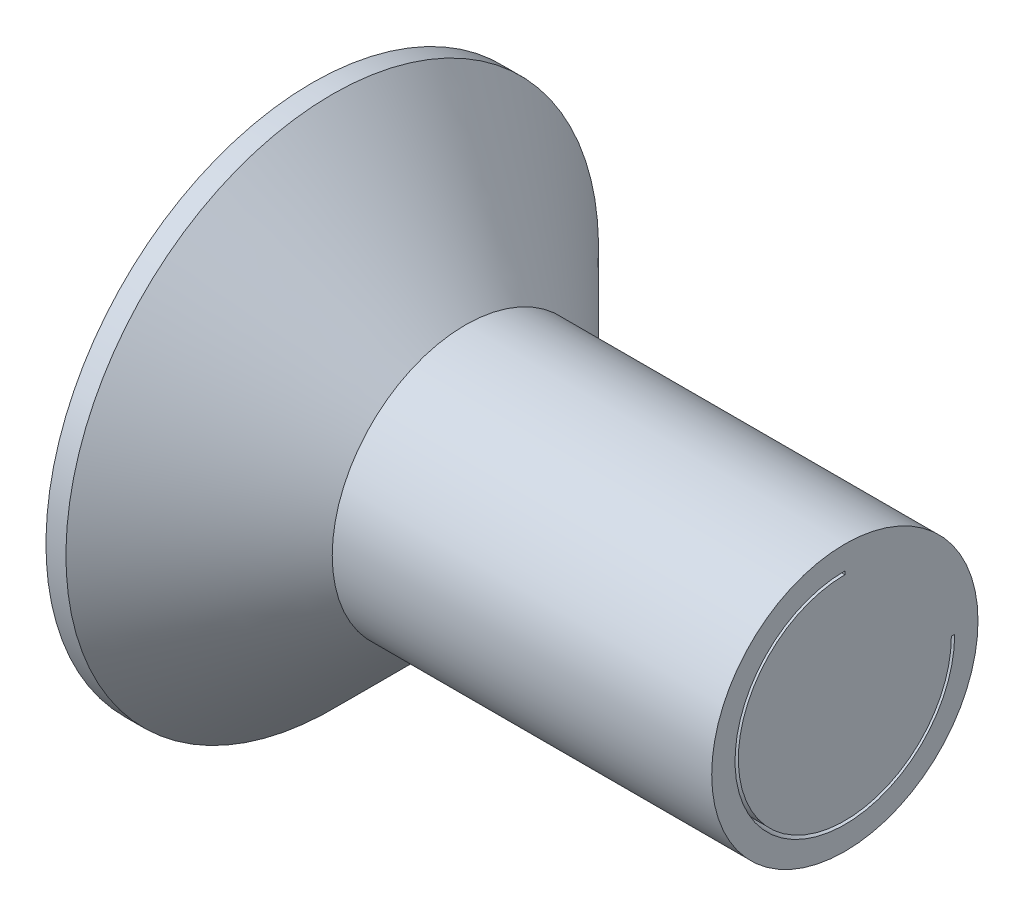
ISO-10303-21;
HEADER;
FILE_DESCRIPTION(('STEP AP214'),'2;1');
FILE_NAME('part.step','',(''),(''),'','','');
FILE_SCHEMA(('AUTOMOTIVE_DESIGN { 1 0 10303 214 1 1 1 1 }'));
ENDSEC;
DATA;
#1=APPLICATION_CONTEXT('core data for automotive mechanical design processes');
#2=APPLICATION_PROTOCOL_DEFINITION('international standard','automotive_design',2000,#1);
#3=PRODUCT_CONTEXT('',#1,'mechanical');
#4=PRODUCT('Part','Part','',(#3));
#5=PRODUCT_RELATED_PRODUCT_CATEGORY('part','',(#4));
#6=PRODUCT_DEFINITION_FORMATION('','',#4);
#7=PRODUCT_DEFINITION_CONTEXT('part definition',#1,'design');
#8=PRODUCT_DEFINITION('design','',#6,#7);
#9=PRODUCT_DEFINITION_SHAPE('','',#8);
#10=(LENGTH_UNIT() NAMED_UNIT(*) SI_UNIT(.MILLI.,.METRE.));
#11=(NAMED_UNIT(*) PLANE_ANGLE_UNIT() SI_UNIT($,.RADIAN.));
#12=(NAMED_UNIT(*) SI_UNIT($,.STERADIAN.) SOLID_ANGLE_UNIT());
#13=UNCERTAINTY_MEASURE_WITH_UNIT(LENGTH_MEASURE(1.E-05),#10,'distance_accuracy_value','');
#14=(GEOMETRIC_REPRESENTATION_CONTEXT(3) GLOBAL_UNCERTAINTY_ASSIGNED_CONTEXT((#13)) GLOBAL_UNIT_ASSIGNED_CONTEXT((#10,
#11,#12)) REPRESENTATION_CONTEXT('',''));
#15=CARTESIAN_POINT('',(0.,0.,0.));
#16=DIRECTION('',(0.,0.,1.));
#17=DIRECTION('',(1.,0.,0.));
#18=AXIS2_PLACEMENT_3D('',#15,#16,#17);
#19=CARTESIAN_POINT('',(-119.,35.0000000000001,86.0000000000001));
#20=DIRECTION('',(1.,0.,0.));
#21=DIRECTION('',(0.,0.,-1.));
#22=AXIS2_PLACEMENT_3D('',#19,#20,#21);
#23=PLANE('',#22);
#24=CARTESIAN_POINT('',(-119.,34.0000000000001,86.0000000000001));
#25=DIRECTION('',(-1.,0.,0.));
#26=DIRECTION('',(0.,1.,0.));
#27=AXIS2_PLACEMENT_3D('',#24,#25,#26);
#28=CIRCLE('',#27,1.6);
#29=CARTESIAN_POINT('',(-119.,34.0000000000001,84.4000000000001));
#30=VERTEX_POINT('',#29);
#31=CARTESIAN_POINT('',(-119.,35.6000000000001,86.0000000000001));
#32=VERTEX_POINT('',#31);
#33=EDGE_CURVE('E9',#30,#32,#28,.T.);
#34=ORIENTED_EDGE('',*,*,#33,.T.);
#35=DIRECTION('',(0.,1.,0.));
#36=VECTOR('',#35,1.);
#37=CARTESIAN_POINT('',(-119.,35.3125000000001,86.0000000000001));
#38=LINE('',#37,#36);
#39=CARTESIAN_POINT('',(-119.,35.6500000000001,86.0000000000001));
#40=VERTEX_POINT('',#39);
#41=EDGE_CURVE('E25',#32,#40,#38,.T.);
#42=ORIENTED_EDGE('',*,*,#41,.T.);
#43=CARTESIAN_POINT('',(-119.,34.0000000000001,86.0000000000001));
#44=DIRECTION('',(1.,0.,0.));
#45=DIRECTION('',(0.,1.,0.));
#46=AXIS2_PLACEMENT_3D('',#43,#44,#45);
#47=CIRCLE('',#46,1.65);
#48=CARTESIAN_POINT('',(-119.,34.0000000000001,84.3500000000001));
#49=VERTEX_POINT('',#48);
#50=EDGE_CURVE('E135',#40,#49,#47,.T.);
#51=ORIENTED_EDGE('',*,*,#50,.T.);
#52=DIRECTION('',(0.,0.,1.));
#53=VECTOR('',#52,1.);
#54=CARTESIAN_POINT('',(-119.,34.0000000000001,85.1875000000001));
#55=LINE('',#54,#53);
#56=EDGE_CURVE('E132',#49,#30,#55,.T.);
#57=ORIENTED_EDGE('',*,*,#56,.T.);
#58=EDGE_LOOP('',(#34,#42,#51,#57));
#59=FACE_BOUND('',#58,.T.);
#60=ADVANCED_FACE('F14',(#59),#23,.T.);
#61=DIRECTION('',(0.707106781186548,-0.707106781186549,0.));
#62=VECTOR('',#61,1.);
#63=CARTESIAN_POINT('',(-499000.,498917.000000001,86.0000000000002));
#64=LINE('',#63,#62);
#65=CARTESIAN_POINT('',(-117.,34.0000000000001,86.0000000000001));
#66=DIRECTION('',(-1.,0.,0.));
#67=AXIS1_PLACEMENT('',#65,#66);
#68=SURFACE_OF_REVOLUTION('',#64,#67);
#69=CARTESIAN_POINT('',(-121.,34.0000000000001,86.0000000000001));
#70=DIRECTION('',(1.,0.,0.));
#71=DIRECTION('',(0.,1.,0.));
#72=AXIS2_PLACEMENT_3D('',#69,#70,#71);
#73=CIRCLE('',#72,4.);
#74=CARTESIAN_POINT('',(-121.,38.0000000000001,86.0000000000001));
#75=VERTEX_POINT('',#74);
#76=EDGE_CURVE('E197',#75,#75,#73,.T.);
#77=ORIENTED_EDGE('',*,*,#76,.T.);
#78=EDGE_LOOP('',(#77));
#79=FACE_BOUND('',#78,.T.);
#80=CARTESIAN_POINT('',(-119.,34.0000000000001,86.0000000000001));
#81=DIRECTION('',(1.,0.,0.));
#82=DIRECTION('',(0.,1.,0.));
#83=AXIS2_PLACEMENT_3D('',#80,#81,#82);
#84=CIRCLE('',#83,2.);
#85=CARTESIAN_POINT('',(-119.,36.0000000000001,86.0000000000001));
#86=VERTEX_POINT('',#85);
#87=EDGE_CURVE('E196',#86,#86,#84,.T.);
#88=ORIENTED_EDGE('',*,*,#87,.F.);
#89=EDGE_LOOP('',(#88));
#90=FACE_BOUND('',#89,.T.);
#91=ADVANCED_FACE('F256',(#79,#90),#68,.F.);
#92=CARTESIAN_POINT('',(-121.15,34.0000000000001,86.0000000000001));
#93=DIRECTION('',(-1.,0.,0.));
#94=DIRECTION('',(0.,0.,1.));
#95=AXIS2_PLACEMENT_3D('',#92,#93,#94);
#96=CYLINDRICAL_SURFACE('',#95,4.);
#97=CARTESIAN_POINT('',(-121.3,34.0000000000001,86.0000000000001));
#98=DIRECTION('',(1.,0.,0.));
#99=DIRECTION('',(0.,1.,0.));
#100=AXIS2_PLACEMENT_3D('',#97,#98,#99);
#101=CIRCLE('',#100,4.);
#102=CARTESIAN_POINT('',(-121.3,38.0000000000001,86.0000000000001));
#103=VERTEX_POINT('',#102);
#104=EDGE_CURVE('E192',#103,#103,#101,.T.);
#105=ORIENTED_EDGE('',*,*,#104,.T.);
#106=EDGE_LOOP('',(#105));
#107=FACE_BOUND('',#106,.T.);
#108=ORIENTED_EDGE('',*,*,#76,.F.);
#109=EDGE_LOOP('',(#108));
#110=FACE_BOUND('',#109,.T.);
#111=ADVANCED_FACE('F248',(#107,#110),#96,.T.);
#112=CARTESIAN_POINT('',(-121.3,36.0000000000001,86.0000000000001));
#113=DIRECTION('',(-1.,0.,0.));
#114=DIRECTION('',(0.,0.,1.));
#115=AXIS2_PLACEMENT_3D('',#112,#113,#114);
#116=PLANE('',#115);
#117=ORIENTED_EDGE('',*,*,#104,.F.);
#118=EDGE_LOOP('',(#117));
#119=FACE_BOUND('',#118,.T.);
#120=DIRECTION('',(0.,-0.499999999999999,0.866025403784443));
#121=VECTOR('',#120,1.);
#122=CARTESIAN_POINT('',(-121.3,35.1521097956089,86.5044872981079));
#123=LINE('',#122,#121);
#124=CARTESIAN_POINT('',(-121.3,35.4433756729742,86.0000000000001));
#125=VERTEX_POINT('',#124);
#126=CARTESIAN_POINT('',(-121.3,34.7216878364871,87.2500000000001));
#127=VERTEX_POINT('',#126);
#128=EDGE_CURVE('E136',#125,#127,#123,.T.);
#129=ORIENTED_EDGE('',*,*,#128,.T.);
#130=DIRECTION('',(0.,-1.,0.));
#131=VECTOR('',#130,1.);
#132=CARTESIAN_POINT('',(-121.3,34.6391560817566,87.2500000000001));
#133=LINE('',#132,#131);
#134=CARTESIAN_POINT('',(-121.3,33.2783121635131,87.2500000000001));
#135=VERTEX_POINT('',#134);
#136=EDGE_CURVE('E188',#127,#135,#133,.T.);
#137=ORIENTED_EDGE('',*,*,#136,.T.);
#138=DIRECTION('',(0.,-0.499999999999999,-0.866025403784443));
#139=VECTOR('',#138,1.);
#140=CARTESIAN_POINT('',(-121.3,32.9870462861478,86.7455127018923));
#141=LINE('',#140,#139);
#142=CARTESIAN_POINT('',(-121.3,32.556624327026,86.0000000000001));
#143=VERTEX_POINT('',#142);
#144=EDGE_CURVE('E166',#135,#143,#141,.T.);
#145=ORIENTED_EDGE('',*,*,#144,.T.);
#146=DIRECTION('',(0.,0.499999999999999,-0.866025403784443));
#147=VECTOR('',#146,1.);
#148=CARTESIAN_POINT('',(-121.3,33.3478902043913,84.6294872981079));
#149=LINE('',#148,#147);
#150=CARTESIAN_POINT('',(-121.3,33.2783121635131,84.7500000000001));
#151=VERTEX_POINT('',#150);
#152=EDGE_CURVE('E163',#143,#151,#149,.T.);
#153=ORIENTED_EDGE('',*,*,#152,.T.);
#154=DIRECTION('',(0.,1.,0.));
#155=VECTOR('',#154,1.);
#156=CARTESIAN_POINT('',(-121.3,35.3608439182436,84.7500000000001));
#157=LINE('',#156,#155);
#158=CARTESIAN_POINT('',(-121.3,34.7216878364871,84.7500000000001));
#159=VERTEX_POINT('',#158);
#160=EDGE_CURVE('E156',#151,#159,#157,.T.);
#161=ORIENTED_EDGE('',*,*,#160,.T.);
#162=DIRECTION('',(0.,0.499999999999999,0.866025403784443));
#163=VECTOR('',#162,1.);
#164=CARTESIAN_POINT('',(-121.3,35.5129537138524,86.1205127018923));
#165=LINE('',#164,#163);
#166=EDGE_CURVE('E141',#159,#125,#165,.T.);
#167=ORIENTED_EDGE('',*,*,#166,.T.);
#168=EDGE_LOOP('',(#129,#137,#145,#153,#161,#167));
#169=FACE_BOUND('',#168,.T.);
#170=ADVANCED_FACE('F246',(#119,#169),#116,.T.);
#171=CARTESIAN_POINT('',(-119.5,34.0000000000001,86.0000000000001));
#172=DIRECTION('',(-1.,0.,0.));
#173=DIRECTION('',(0.,-1.,0.));
#174=AXIS2_PLACEMENT_3D('',#171,#172,#173);
#175=PLANE('',#174);
#176=DIRECTION('',(0.,0.499999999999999,-0.866025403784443));
#177=VECTOR('',#176,1.);
#178=CARTESIAN_POINT('',(-119.5,34.7216878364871,87.2500000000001));
#179=LINE('',#178,#177);
#180=CARTESIAN_POINT('',(-119.5,34.7216878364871,87.2500000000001));
#181=VERTEX_POINT('',#180);
#182=CARTESIAN_POINT('',(-119.5,35.4433756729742,86.0000000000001));
#183=VERTEX_POINT('',#182);
#184=EDGE_CURVE('E137',#181,#183,#179,.T.);
#185=ORIENTED_EDGE('',*,*,#184,.T.);
#186=DIRECTION('',(0.,-0.499999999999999,-0.866025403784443));
#187=VECTOR('',#186,1.);
#188=CARTESIAN_POINT('',(-119.5,35.4433756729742,86.0000000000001));
#189=LINE('',#188,#187);
#190=CARTESIAN_POINT('',(-119.5,34.7216878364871,84.7500000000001));
#191=VERTEX_POINT('',#190);
#192=EDGE_CURVE('E130',#183,#191,#189,.T.);
#193=ORIENTED_EDGE('',*,*,#192,.T.);
#194=DIRECTION('',(0.,-1.,0.));
#195=VECTOR('',#194,1.);
#196=CARTESIAN_POINT('',(-119.5,34.7216878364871,84.7500000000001));
#197=LINE('',#196,#195);
#198=CARTESIAN_POINT('',(-119.5,33.2783121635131,84.7500000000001));
#199=VERTEX_POINT('',#198);
#200=EDGE_CURVE('E126',#191,#199,#197,.T.);
#201=ORIENTED_EDGE('',*,*,#200,.T.);
#202=DIRECTION('',(0.,-0.499999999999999,0.866025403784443));
#203=VECTOR('',#202,1.);
#204=CARTESIAN_POINT('',(-119.5,33.2783121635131,84.7500000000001));
#205=LINE('',#204,#203);
#206=CARTESIAN_POINT('',(-119.5,32.556624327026,86.0000000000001));
#207=VERTEX_POINT('',#206);
#208=EDGE_CURVE('E131',#199,#207,#205,.T.);
#209=ORIENTED_EDGE('',*,*,#208,.T.);
#210=DIRECTION('',(0.,0.499999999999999,0.866025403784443));
#211=VECTOR('',#210,1.);
#212=CARTESIAN_POINT('',(-119.5,32.556624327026,86.0000000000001));
#213=LINE('',#212,#211);
#214=CARTESIAN_POINT('',(-119.5,33.2783121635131,87.2500000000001));
#215=VERTEX_POINT('',#214);
#216=EDGE_CURVE('E142',#207,#215,#213,.T.);
#217=ORIENTED_EDGE('',*,*,#216,.T.);
#218=DIRECTION('',(0.,1.,0.));
#219=VECTOR('',#218,1.);
#220=CARTESIAN_POINT('',(-119.5,33.2783121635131,87.2500000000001));
#221=LINE('',#220,#219);
#222=EDGE_CURVE('E146',#215,#181,#221,.T.);
#223=ORIENTED_EDGE('',*,*,#222,.T.);
#224=EDGE_LOOP('',(#185,#193,#201,#209,#217,#223));
#225=FACE_BOUND('',#224,.T.);
#226=ADVANCED_FACE('F222',(#225),#175,.T.);
#227=CARTESIAN_POINT('',(-121.3,33.2783121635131,87.2500000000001));
#228=DIRECTION('',(0.,0.,-1.));
#229=DIRECTION('',(-1.,0.,0.));
#230=AXIS2_PLACEMENT_3D('',#227,#228,#229);
#231=PLANE('',#230);
#232=ORIENTED_EDGE('',*,*,#222,.F.);
#233=DIRECTION('',(1.,0.,0.));
#234=VECTOR('',#233,1.);
#235=CARTESIAN_POINT('',(-121.3,33.2783121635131,87.2500000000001));
#236=LINE('',#235,#234);
#237=EDGE_CURVE('E172',#135,#215,#236,.T.);
#238=ORIENTED_EDGE('',*,*,#237,.F.);
#239=ORIENTED_EDGE('',*,*,#136,.F.);
#240=DIRECTION('',(1.,0.,0.));
#241=VECTOR('',#240,1.);
#242=CARTESIAN_POINT('',(-121.3,34.7216878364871,87.2500000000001));
#243=LINE('',#242,#241);
#244=EDGE_CURVE('E160',#127,#181,#243,.T.);
#245=ORIENTED_EDGE('',*,*,#244,.T.);
#246=EDGE_LOOP('',(#232,#238,#239,#245));
#247=FACE_BOUND('',#246,.T.);
#248=ADVANCED_FACE('F230',(#247),#231,.T.);
#249=CARTESIAN_POINT('',(-121.3,32.556624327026,86.0000000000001));
#250=DIRECTION('',(0.,0.866025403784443,-0.499999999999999));
#251=DIRECTION('',(0.,0.499999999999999,0.866025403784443));
#252=AXIS2_PLACEMENT_3D('',#249,#250,#251);
#253=PLANE('',#252);
#254=ORIENTED_EDGE('',*,*,#216,.F.);
#255=DIRECTION('',(1.,0.,0.));
#256=VECTOR('',#255,1.);
#257=CARTESIAN_POINT('',(-121.3,32.556624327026,86.0000000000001));
#258=LINE('',#257,#256);
#259=EDGE_CURVE('E180',#143,#207,#258,.T.);
#260=ORIENTED_EDGE('',*,*,#259,.F.);
#261=ORIENTED_EDGE('',*,*,#144,.F.);
#262=ORIENTED_EDGE('',*,*,#237,.T.);
#263=EDGE_LOOP('',(#254,#260,#261,#262));
#264=FACE_BOUND('',#263,.T.);
#265=ADVANCED_FACE('F226',(#264),#253,.T.);
#266=CARTESIAN_POINT('',(-121.3,33.2783121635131,84.7500000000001));
#267=DIRECTION('',(0.,0.866025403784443,0.499999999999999));
#268=DIRECTION('',(0.,-0.499999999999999,0.866025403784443));
#269=AXIS2_PLACEMENT_3D('',#266,#267,#268);
#270=PLANE('',#269);
#271=ORIENTED_EDGE('',*,*,#208,.F.);
#272=DIRECTION('',(1.,0.,0.));
#273=VECTOR('',#272,1.);
#274=CARTESIAN_POINT('',(-121.3,33.2783121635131,84.7500000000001));
#275=LINE('',#274,#273);
#276=EDGE_CURVE('E178',#151,#199,#275,.T.);
#277=ORIENTED_EDGE('',*,*,#276,.F.);
#278=ORIENTED_EDGE('',*,*,#152,.F.);
#279=ORIENTED_EDGE('',*,*,#259,.T.);
#280=EDGE_LOOP('',(#271,#277,#278,#279));
#281=FACE_BOUND('',#280,.T.);
#282=ADVANCED_FACE('F244',(#281),#270,.T.);
#283=CARTESIAN_POINT('',(-121.3,34.7216878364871,84.7500000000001));
#284=DIRECTION('',(0.,0.,1.));
#285=DIRECTION('',(1.,0.,0.));
#286=AXIS2_PLACEMENT_3D('',#283,#284,#285);
#287=PLANE('',#286);
#288=ORIENTED_EDGE('',*,*,#200,.F.);
#289=DIRECTION('',(1.,0.,0.));
#290=VECTOR('',#289,1.);
#291=CARTESIAN_POINT('',(-121.3,34.7216878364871,84.7500000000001));
#292=LINE('',#291,#290);
#293=EDGE_CURVE('E175',#159,#191,#292,.T.);
#294=ORIENTED_EDGE('',*,*,#293,.F.);
#295=ORIENTED_EDGE('',*,*,#160,.F.);
#296=ORIENTED_EDGE('',*,*,#276,.T.);
#297=EDGE_LOOP('',(#288,#294,#295,#296));
#298=FACE_BOUND('',#297,.T.);
#299=ADVANCED_FACE('F241',(#298),#287,.T.);
#300=CARTESIAN_POINT('',(-121.3,35.4433756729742,86.0000000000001));
#301=DIRECTION('',(0.,-0.866025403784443,0.499999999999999));
#302=DIRECTION('',(0.,-0.499999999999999,-0.866025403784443));
#303=AXIS2_PLACEMENT_3D('',#300,#301,#302);
#304=PLANE('',#303);
#305=ORIENTED_EDGE('',*,*,#192,.F.);
#306=DIRECTION('',(1.,0.,0.));
#307=VECTOR('',#306,1.);
#308=CARTESIAN_POINT('',(-121.3,35.4433756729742,86.0000000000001));
#309=LINE('',#308,#307);
#310=EDGE_CURVE('E149',#125,#183,#309,.T.);
#311=ORIENTED_EDGE('',*,*,#310,.F.);
#312=ORIENTED_EDGE('',*,*,#166,.F.);
#313=ORIENTED_EDGE('',*,*,#293,.T.);
#314=EDGE_LOOP('',(#305,#311,#312,#313));
#315=FACE_BOUND('',#314,.T.);
#316=ADVANCED_FACE('F239',(#315),#304,.T.);
#317=CARTESIAN_POINT('',(-121.3,34.7216878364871,87.2500000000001));
#318=DIRECTION('',(0.,-0.866025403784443,-0.499999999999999));
#319=DIRECTION('',(0.,0.499999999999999,-0.866025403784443));
#320=AXIS2_PLACEMENT_3D('',#317,#318,#319);
#321=PLANE('',#320);
#322=ORIENTED_EDGE('',*,*,#184,.F.);
#323=ORIENTED_EDGE('',*,*,#244,.F.);
#324=ORIENTED_EDGE('',*,*,#128,.F.);
#325=ORIENTED_EDGE('',*,*,#310,.T.);
#326=EDGE_LOOP('',(#322,#323,#324,#325));
#327=FACE_BOUND('',#326,.T.);
#328=ADVANCED_FACE('F234',(#327),#321,.T.);
#329=CARTESIAN_POINT('',(-113.3,34.0000000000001,86.0000000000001));
#330=DIRECTION('',(1.,0.,0.));
#331=DIRECTION('',(0.,0.,-1.));
#332=AXIS2_PLACEMENT_3D('',#329,#330,#331);
#333=PLANE('',#332);
#334=CARTESIAN_POINT('',(-113.3,34.0000000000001,86.0000000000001));
#335=DIRECTION('',(1.,0.,0.));
#336=DIRECTION('',(0.,0.,-1.));
#337=AXIS2_PLACEMENT_3D('',#334,#335,#336);
#338=CIRCLE('',#337,2.);
#339=CARTESIAN_POINT('',(-113.3,34.0000000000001,84.0000000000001));
#340=VERTEX_POINT('',#339);
#341=EDGE_CURVE('E110',#340,#340,#338,.T.);
#342=ORIENTED_EDGE('',*,*,#341,.T.);
#343=EDGE_LOOP('',(#342));
#344=FACE_BOUND('',#343,.T.);
#345=CARTESIAN_POINT('',(-113.3,34.0000000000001,86.0000000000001));
#346=DIRECTION('',(1.,0.,0.));
#347=DIRECTION('',(0.,1.,0.));
#348=AXIS2_PLACEMENT_3D('',#345,#346,#347);
#349=CIRCLE('',#348,1.6);
#350=CARTESIAN_POINT('',(-113.3,35.6000000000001,86.0000000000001));
#351=VERTEX_POINT('',#350);
#352=CARTESIAN_POINT('',(-113.3,34.0000000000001,84.4000000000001));
#353=VERTEX_POINT('',#352);
#354=EDGE_CURVE('E104',#351,#353,#349,.T.);
#355=ORIENTED_EDGE('',*,*,#354,.T.);
#356=DIRECTION('',(0.,0.,-1.));
#357=VECTOR('',#356,1.);
#358=CARTESIAN_POINT('',(-113.3,34.0000000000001,85.1875000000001));
#359=LINE('',#358,#357);
#360=CARTESIAN_POINT('',(-113.3,34.0000000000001,84.3500000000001));
#361=VERTEX_POINT('',#360);
#362=EDGE_CURVE('E111',#353,#361,#359,.T.);
#363=ORIENTED_EDGE('',*,*,#362,.T.);
#364=CARTESIAN_POINT('',(-113.3,34.0000000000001,86.0000000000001));
#365=DIRECTION('',(-1.,0.,0.));
#366=DIRECTION('',(0.,1.,0.));
#367=AXIS2_PLACEMENT_3D('',#364,#365,#366);
#368=CIRCLE('',#367,1.65);
#369=CARTESIAN_POINT('',(-113.3,35.6500000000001,86.0000000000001));
#370=VERTEX_POINT('',#369);
#371=EDGE_CURVE('E114',#361,#370,#368,.T.);
#372=ORIENTED_EDGE('',*,*,#371,.T.);
#373=DIRECTION('',(0.,-1.,0.));
#374=VECTOR('',#373,1.);
#375=CARTESIAN_POINT('',(-113.3,34.8125000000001,86.0000000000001));
#376=LINE('',#375,#374);
#377=EDGE_CURVE('E98',#370,#351,#376,.T.);
#378=ORIENTED_EDGE('',*,*,#377,.T.);
#379=EDGE_LOOP('',(#355,#363,#372,#378));
#380=FACE_BOUND('',#379,.T.);
#381=ADVANCED_FACE('F113',(#344,#380),#333,.T.);
#382=CARTESIAN_POINT('',(-116.15,34.0000000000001,86.0000000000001));
#383=DIRECTION('',(-1.,0.,0.));
#384=DIRECTION('',(0.,0.,1.));
#385=AXIS2_PLACEMENT_3D('',#382,#383,#384);
#386=CYLINDRICAL_SURFACE('',#385,2.);
#387=ORIENTED_EDGE('',*,*,#87,.T.);
#388=EDGE_LOOP('',(#387));
#389=FACE_BOUND('',#388,.T.);
#390=ORIENTED_EDGE('',*,*,#341,.F.);
#391=EDGE_LOOP('',(#390));
#392=FACE_BOUND('',#391,.T.);
#393=ADVANCED_FACE('F271',(#389,#392),#386,.T.);
#394=CARTESIAN_POINT('',(-116.15,34.0000000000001,84.3750000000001));
#395=DIRECTION('',(0.,-1.,0.));
#396=DIRECTION('',(0.,0.,-1.));
#397=AXIS2_PLACEMENT_3D('',#394,#395,#396);
#398=PLANE('',#397);
#399=DIRECTION('',(1.,0.,0.));
#400=VECTOR('',#399,1.);
#401=CARTESIAN_POINT('',(-113.3,34.0000000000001,84.3500000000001));
#402=LINE('',#401,#400);
#403=EDGE_CURVE('E116',#49,#361,#402,.T.);
#404=ORIENTED_EDGE('',*,*,#403,.T.);
#405=ORIENTED_EDGE('',*,*,#362,.F.);
#406=DIRECTION('',(-1.,0.,0.));
#407=VECTOR('',#406,1.);
#408=CARTESIAN_POINT('',(-119.,34.0000000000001,84.4000000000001));
#409=LINE('',#408,#407);
#410=EDGE_CURVE('E101',#353,#30,#409,.T.);
#411=ORIENTED_EDGE('',*,*,#410,.T.);
#412=ORIENTED_EDGE('',*,*,#56,.F.);
#413=EDGE_LOOP('',(#404,#405,#411,#412));
#414=FACE_BOUND('',#413,.T.);
#415=ADVANCED_FACE('F274',(#414),#398,.T.);
#416=CARTESIAN_POINT('',(-116.15,35.6250000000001,86.0000000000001));
#417=DIRECTION('',(0.,0.,1.));
#418=DIRECTION('',(1.,0.,0.));
#419=AXIS2_PLACEMENT_3D('',#416,#417,#418);
#420=PLANE('',#419);
#421=ORIENTED_EDGE('',*,*,#41,.F.);
#422=DIRECTION('',(1.,0.,0.));
#423=VECTOR('',#422,1.);
#424=CARTESIAN_POINT('',(-119.,35.6000000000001,86.0000000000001));
#425=LINE('',#424,#423);
#426=EDGE_CURVE('E94',#32,#351,#425,.T.);
#427=ORIENTED_EDGE('',*,*,#426,.T.);
#428=ORIENTED_EDGE('',*,*,#377,.F.);
#429=DIRECTION('',(-1.,0.,0.));
#430=VECTOR('',#429,1.);
#431=CARTESIAN_POINT('',(-113.3,35.6500000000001,86.0000000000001));
#432=LINE('',#431,#430);
#433=EDGE_CURVE('E88',#370,#40,#432,.T.);
#434=ORIENTED_EDGE('',*,*,#433,.T.);
#435=EDGE_LOOP('',(#421,#427,#428,#434));
#436=FACE_BOUND('',#435,.T.);
#437=ADVANCED_FACE('F96',(#436),#420,.T.);
#438=CARTESIAN_POINT('',(-116.15,34.0000000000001,86.0000000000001));
#439=DIRECTION('',(-1.,0.,0.));
#440=DIRECTION('',(0.,0.,1.));
#441=AXIS2_PLACEMENT_3D('',#438,#439,#440);
#442=CYLINDRICAL_SURFACE('',#441,1.6);
#443=ORIENTED_EDGE('',*,*,#426,.F.);
#444=ORIENTED_EDGE('',*,*,#33,.F.);
#445=ORIENTED_EDGE('',*,*,#410,.F.);
#446=ORIENTED_EDGE('',*,*,#354,.F.);
#447=EDGE_LOOP('',(#443,#444,#445,#446));
#448=FACE_BOUND('',#447,.T.);
#449=ADVANCED_FACE('F105',(#448),#442,.T.);
#450=CARTESIAN_POINT('',(-116.15,34.0000000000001,86.0000000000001));
#451=DIRECTION('',(-1.,0.,0.));
#452=DIRECTION('',(0.,0.,1.));
#453=AXIS2_PLACEMENT_3D('',#450,#451,#452);
#454=CYLINDRICAL_SURFACE('',#453,1.65);
#455=ORIENTED_EDGE('',*,*,#50,.F.);
#456=ORIENTED_EDGE('',*,*,#433,.F.);
#457=ORIENTED_EDGE('',*,*,#371,.F.);
#458=ORIENTED_EDGE('',*,*,#403,.F.);
#459=EDGE_LOOP('',(#455,#456,#457,#458));
#460=FACE_BOUND('',#459,.T.);
#461=ADVANCED_FACE('F16',(#460),#454,.F.);
#462=CLOSED_SHELL('',(#60,#91,#111,#170,#226,#248,#265,#282,#299,#316,#328,#381,#393,#415,#437,
#449,#461));
#463=MANIFOLD_SOLID_BREP('B1',#462);
#464=ADVANCED_BREP_SHAPE_REPRESENTATION('',(#18,#463),#14);
#465=SHAPE_DEFINITION_REPRESENTATION(#9,#464);
ENDSEC;
END-ISO-10303-21;
